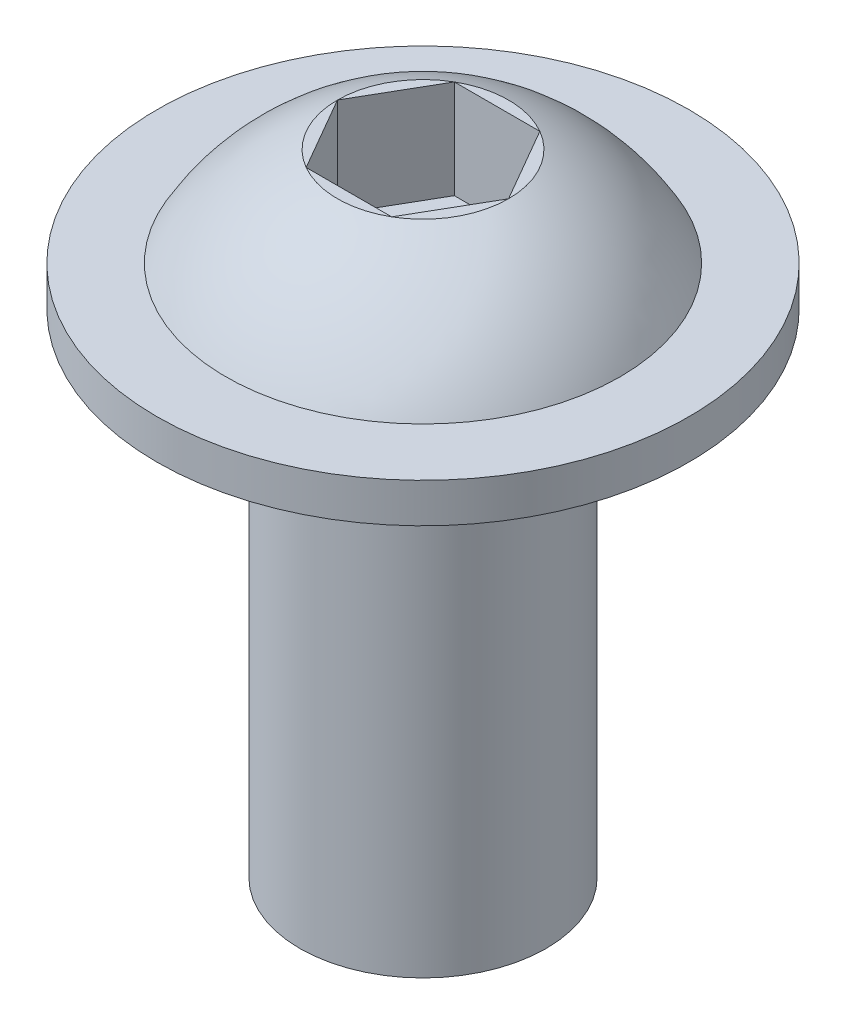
from build123d import *

# Parameters (mm, degrees)
HEX_CUT_DEPTH = 3.175


with BuildPart() as part:
    # Sketch1 → Screw revolve (revolve)
    with BuildSketch(Plane.XY, mode=Mode.PRIVATE) as screw_revolve_sk:
        with BuildLine():
            Line((0, 0), (3.96875, 0))
            Line((3.96875, 0), (3.96875, 15.875))
            Line((3.96875, 15.875), (8.5725, 15.875))
            Line((8.5725, 15.875), (8.5725, 17.145))
            Line((8.5725, 17.145), (6.35, 17.145))
            ThreePointArc((6.35, 17.145), (4.822276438, 19.036685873), (2.756963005, 20.32))
            Line((2.756963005, 20.32), (0, 20.32))
            Line((0, 20.32), (0, 0))
        make_face()
    revolve(screw_revolve_sk.sketch.rotate(Axis((0, 0, 0), (0, 1, 0)), 90), axis=Axis((0, 0, 0), (0, 1, 0)))

    # Sketch2 → Hex Cut (cut)
    with BuildSketch(Plane(origin=(0, 20.32, 0), x_dir=(-1, 0, 0), z_dir=(0, 1, 0))):
        Polygon((-2.756963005, 0), (-1.378481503, -2.3876), (1.378481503, -2.3876), (2.756963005, 0), (1.378481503, 2.3876), (-1.378481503, 2.3876), align=None)
    extrude(amount=-HEX_CUT_DEPTH, mode=Mode.SUBTRACT)


solid = part.part
